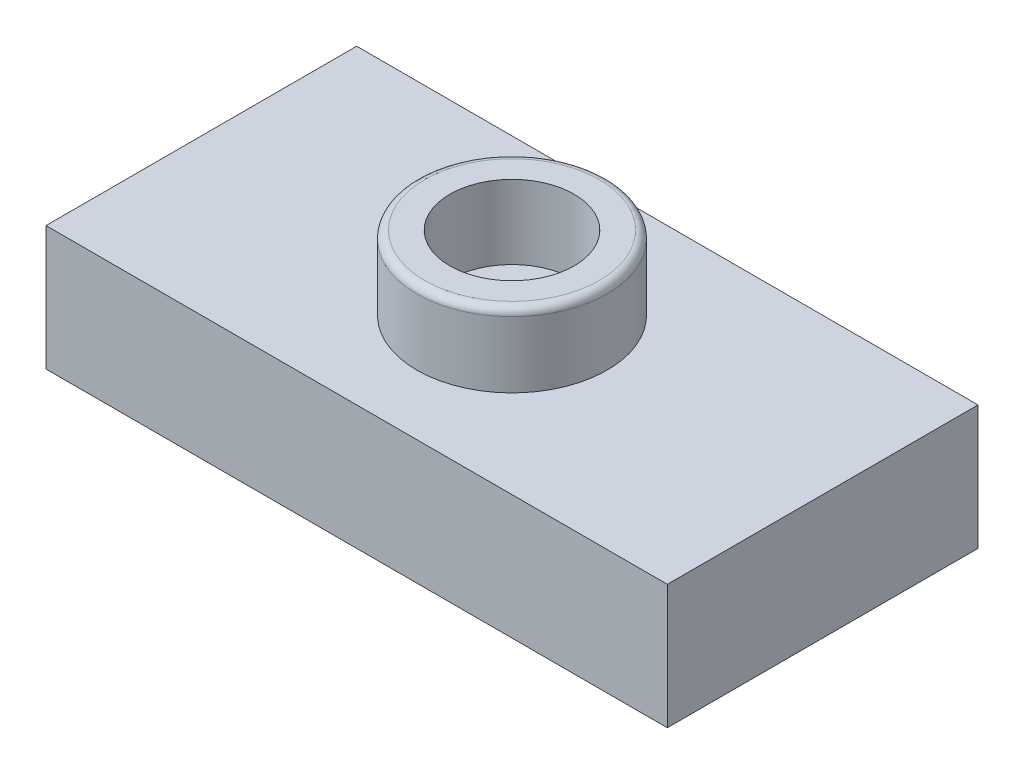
from build123d import *

# Parameters (mm, degrees)
SKIZZE1_W                       = 16
SKIZZE1_H                       = 8
LINEAR_AUSTRAGEN1_DEPTH         = 3.2
SKIZZE2_W                       = 12.8
SKIZZE2_H                       = 4.8
SCHNITT_LINEAR_AUSTRAGEN1_DEPTH = 2.1
SKIZZE3_R                       = 1.6
LINEAR_AUSTRAGEN2_DEPTH         = 1.9
VERRUNDUNG1_R                   = 0.2
SKIZZE5_R                       = 2.45
LINEAR_AUSTRAGEN3_DEPTH         = 1.9
VERRUNDUNG2_R                   = 0.2
SKIZZE6_R                       = 1.6
SCHNITT_LINEAR_AUSTRAGEN2_DEPTH = 1.9


with BuildPart() as part:
    # Skizze1 → Linear austragen1 (new body)
    with BuildSketch(Plane(origin=(0, 0, 0), x_dir=(1, 0, 0), z_dir=(0, 1, 0))):
        with Locations((8, 4)):
            Rectangle(SKIZZE1_W, SKIZZE1_H)
    extrude(amount=LINEAR_AUSTRAGEN1_DEPTH)

    # Skizze2 → Schnitt-Linear austragen1 (cut)
    with BuildSketch(Plane.XZ):
        with Locations((8, -4)):
            Rectangle(SKIZZE2_W, SKIZZE2_H)
    extrude(amount=-SCHNITT_LINEAR_AUSTRAGEN1_DEPTH, mode=Mode.SUBTRACT)

    # Skizze3 → Linear austragen2 (add)
    with BuildSketch(Plane.XZ.offset(-2.1)):
        with Locations(Location((8, -4, 0), (0, 0, 90))):
            Circle(SKIZZE3_R)
    extrude(amount=LINEAR_AUSTRAGEN2_DEPTH)

    # Verrundung1
    verrundung1_edges = [part.edges().sort_by_distance(p)[0] for p in [
        (8, 0.2, -5.6),
    ]]
    fillet(verrundung1_edges, radius=VERRUNDUNG1_R)

    # Skizze5 → Linear austragen3 (add)
    with BuildSketch(Plane(origin=(0, 3.2, 0), x_dir=(-1, 0, 0), z_dir=(0, 1, 0))):
        with Locations(Location((-8, -4, 0), (0, 0, 270))):
            Circle(SKIZZE5_R)
    extrude(amount=LINEAR_AUSTRAGEN3_DEPTH)

    # Verrundung2
    verrundung2_edges = [part.edges().sort_by_distance(p)[0] for p in [
        (8, 5.1, -1.55),
    ]]
    fillet(verrundung2_edges, radius=VERRUNDUNG2_R)

    # Skizze6 → Schnitt-Linear austragen2 (cut)
    with BuildSketch(Plane(origin=(0, 5.1, 0), x_dir=(-1, 0, 0), z_dir=(0, 1, 0))):
        with Locations(Location((-8, -4, 0), (0, 0, 90))):
            Circle(SKIZZE6_R)
    extrude(amount=-SCHNITT_LINEAR_AUSTRAGEN2_DEPTH, mode=Mode.SUBTRACT)


solid = part.part
